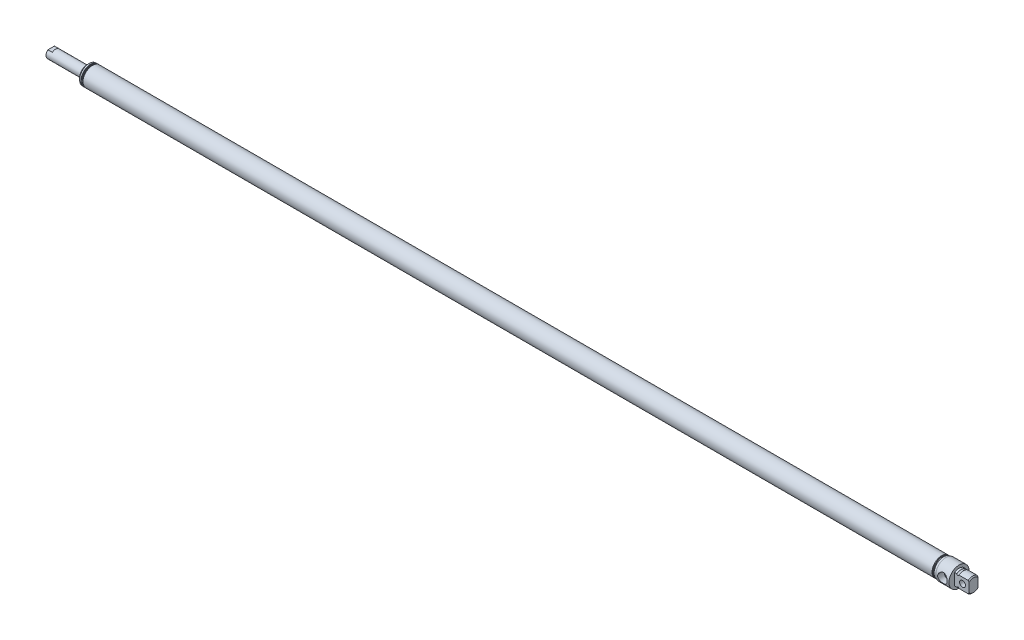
from build123d import *

# Parameters (mm, degrees)
SKETCH8_R                 = 7.9375
BOSS_EXTRUDE1_DEPTH       = 15.748
CUT_EXTRUDE1_REACH        = 1001.99
SKETCH10_R                = 3.175
F_0_25_DIA_PIN_HOLE_DEPTH = 9.652
WRENCH_FLATS_DEPTH        = 4.826
CHAMFER1_SIZE             = 1.016


with BuildPart() as part:
    # Sketch2 → Base-Revolve (revolve)
    with BuildSketch(Plane.XY, mode=Mode.PRIVATE) as base_revolve_sk:
        Polygon((974.725, 10.287), (45.974, 10.287), (45.974, 7.9375), (43.688, 7.9375), (43.688, 5.55625), (4.826, 5.55625), (4.826, 0), (988.949, 0), (988.949, 10.922), (974.725, 10.922), align=None)
    revolve(base_revolve_sk.sketch.rotate(Axis((-21.417447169, 0, 0), (1, 0, 0)), 90), axis=Axis((-21.417447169, 0, 0), (1, 0, 0)))

    # Sketch6 → Cavity (revolve, cut)
    with BuildSketch(Plane.XY, mode=Mode.PRIVATE) as cavity_sk:
        Polygon((790.5115, 0), (790.5115, 9.525), (244.4115, 9.525), (244.4115, 3.175), (4.826, 3.175), (4.826, 0), align=None)
    revolve(cavity_sk.sketch.rotate(Axis((0, 0, 0), (-1, 0, 0)), 90), axis=Axis((0, 0, 0), (-1, 0, 0)), mode=Mode.SUBTRACT)

    # Sketch8 → Boss-Extrude1 (add)
    with BuildSketch(Plane(origin=(988.949, 0, 0), x_dir=(0, 0, -1), z_dir=(1, 0, 0))):
        with Locations(Location((0, 0, 0), (0, 0, 180))):
            Circle(SKETCH8_R)
    extrude(amount=BOSS_EXTRUDE1_DEPTH)

    # Sketch11 → Cut-Revolve3 (revolve, cut)
    with BuildSketch(Plane.XY, mode=Mode.PRIVATE) as cut_revolve3_sk:
        with BuildLine():
            Line((991.362, -7.9375), (993.648, -7.9375))
            ThreePointArc((993.648, -7.9375), (992.505, -7.221080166), (991.362, -7.9375))
        make_face()
    revolve(cut_revolve3_sk.sketch.rotate(Axis((0, 0, 0), (1, 0, 0)), 270), axis=Axis((0, 0, 0), (1, 0, 0)), mode=Mode.SUBTRACT)

    # Cut-Extrude1: up to this face of the body (flat: up to its plane)
    cut_extrude1_end = Plane(part.part.faces().sort_by_distance((988.949, 0, -10.613079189))[0])
    # Sketch9 → Cut-Extrude1 (cut, up to the picked face)
    with BuildSketch(Plane(origin=(1004.697, 0, 0), x_dir=(0, 0, -1), z_dir=(1, 0, 0)), mode=Mode.PRIVATE) as cut_extrude1_sk1:
        with BuildLine():
            Line((-4.826, 6.301875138), (-4.826, -6.301875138))
            ThreePointArc((-4.826, -6.301875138), (-7.9375, 0), (-4.826, 6.301875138))
        make_face()
    cut_extrude1_tool1 = split(extrude(cut_extrude1_sk1.sketch, amount=-CUT_EXTRUDE1_REACH, mode=Mode.PRIVATE), bisect_by=cut_extrude1_end, keep=Keep.BOTH, mode=Mode.PRIVATE)
    # Sketch9 → Cut-Extrude1 (cut, up to the picked face)
    with BuildSketch(Plane(origin=(1004.697, 0, 0), x_dir=(0, 0, -1), z_dir=(1, 0, 0)), mode=Mode.PRIVATE) as cut_extrude1_sk2:
        with BuildLine():
            Line((4.826, 6.301875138), (4.826, -6.301875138))
            ThreePointArc((4.826, -6.301875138), (7.9375, 0), (4.826, 6.301875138))
        make_face()
    cut_extrude1_tool2 = split(extrude(cut_extrude1_sk2.sketch, amount=-CUT_EXTRUDE1_REACH, mode=Mode.PRIVATE), bisect_by=cut_extrude1_end, keep=Keep.BOTH, mode=Mode.PRIVATE)
    add(cut_extrude1_tool1.solids().sort_by(Axis((1004.697, 0, 6.094209), (-1, 0, 0)))[0], mode=Mode.SUBTRACT)
    add(cut_extrude1_tool2.solids().sort_by(Axis((1004.697, 0, -6.094209), (-1, 0, 0)))[0], mode=Mode.SUBTRACT)

    # Sketch10 → 0.25 Dia Pin Hole (cut)
    with BuildSketch(Plane.XY.offset(4.826)):
        with Locations((997.585, 0)):
            Circle(SKETCH10_R)
    extrude(amount=-F_0_25_DIA_PIN_HOLE_DEPTH, mode=Mode.SUBTRACT)

    # Sketch3 → Cut-Revolve1 (revolve, cut)
    with BuildSketch(Plane.XY, mode=Mode.PRIVATE) as cut_revolve1_sk:
        Polygon((47.498, 10.287), (47.498, 9.398), (48.387, 10.287), align=None)
        Polygon((48.768, 10.287), (48.768, 9.398), (49.657, 10.287), align=None)
    revolve(cut_revolve1_sk.sketch.rotate(Axis((0, 0, 0), (1, 0, 0)), 90), axis=Axis((0, 0, 0), (1, 0, 0)), mode=Mode.SUBTRACT)

    # Sketch12 → Cut-Revolve4 (revolve, cut)
    with BuildSketch(Plane.XY, mode=Mode.PRIVATE) as cut_revolve4_sk:
        Polygon((970.026, 10.287), (970.915, 9.398), (970.915, 10.287), align=None)
        Polygon((971.296, 10.287), (972.185, 9.398), (972.185, 10.287), align=None)
    revolve(cut_revolve4_sk.sketch.rotate(Axis((159.760209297, 0, 0), (-1, 0, 0)), 90), axis=Axis((159.760209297, 0, 0), (-1, 0, 0)), mode=Mode.SUBTRACT)

    # Sketch15 → Wrench Flats (cut)
    with BuildSketch(Plane.ZY.offset(-4.826)):
        with BuildLine():
            Line((-3.496682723, -4.318), (3.496682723, -4.318))
            ThreePointArc((3.496682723, -4.318), (0, -5.55625), (-3.496682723, -4.318))
        make_face()
        with BuildLine():
            Line((-3.496682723, 4.318), (3.496682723, 4.318))
            ThreePointArc((3.496682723, 4.318), (0, 5.55625), (-3.496682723, 4.318))
        make_face()
    extrude(amount=-WRENCH_FLATS_DEPTH, mode=Mode.SUBTRACT)

    # Sketch13 → 1_8 NPT REAR SIDE PORT (revolve, cut)
    with BuildSketch(Plane(origin=(981.837, 0, 10.922), x_dir=(0, -1, 0), z_dir=(1, 0, 0))):
        Polygon((0, 0), (0, 14.156457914), (4.2164, 11.6229892), (4.2164, 6.9239892), (4.936186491, 6.9239892), (5.1435, 0), align=None)
    revolve(axis=Axis((981.837, 0, 17.272), (0, 0, -1)), mode=Mode.SUBTRACT)

    # Chamfer1
    chamfer1_edges = [part.edges().sort_by_distance(p)[0] for p in [
        (1004.697, 7.9375, 0),
        (1004.697, -7.9375, 0),
    ]]
    chamfer(chamfer1_edges, length=CHAMFER1_SIZE)


solid = part.part
